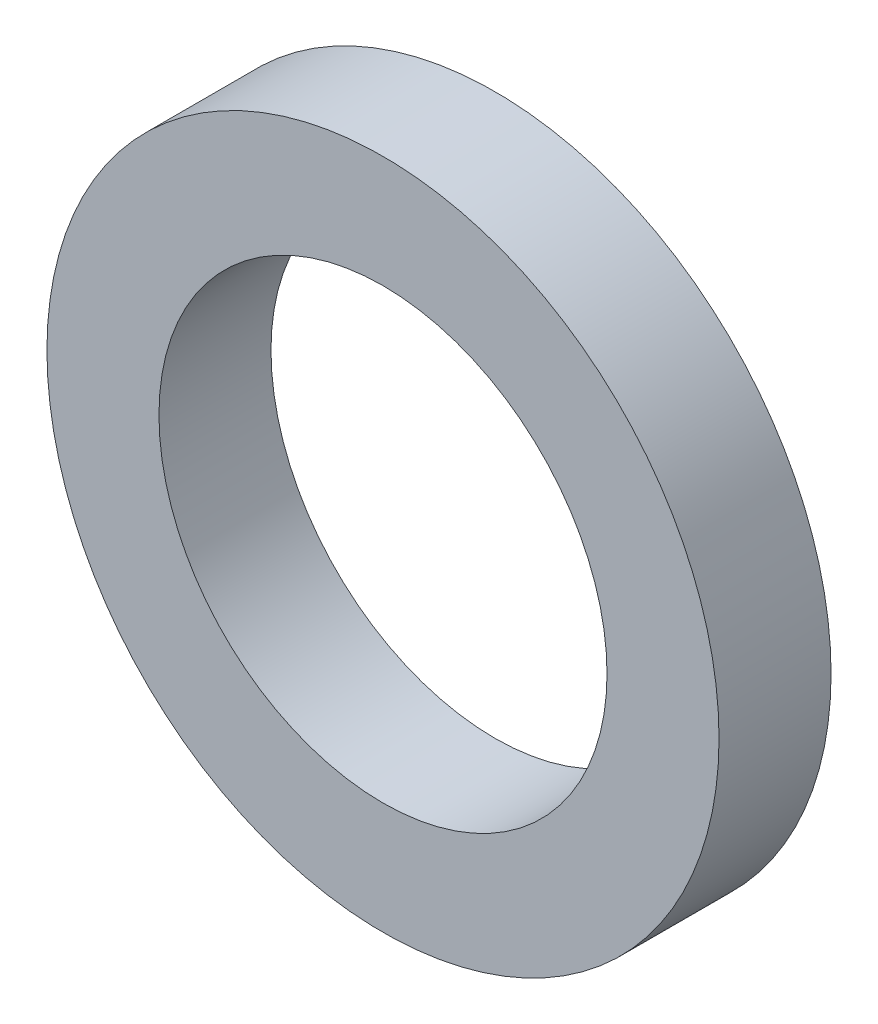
from build123d import *

# Parameters (mm, degrees)
SKETCH1_R          = 9.525
SKETCH1_R_2        = 6.35
BASE_EXTRUDE_DEPTH = 3.175


with BuildPart() as part:
    # Sketch1 → Base-Extrude (new body)
    with BuildSketch(Plane.XY):
        Circle(SKETCH1_R)
        Circle(SKETCH1_R_2, mode=Mode.SUBTRACT)
    extrude(amount=BASE_EXTRUDE_DEPTH)


solid = part.part
